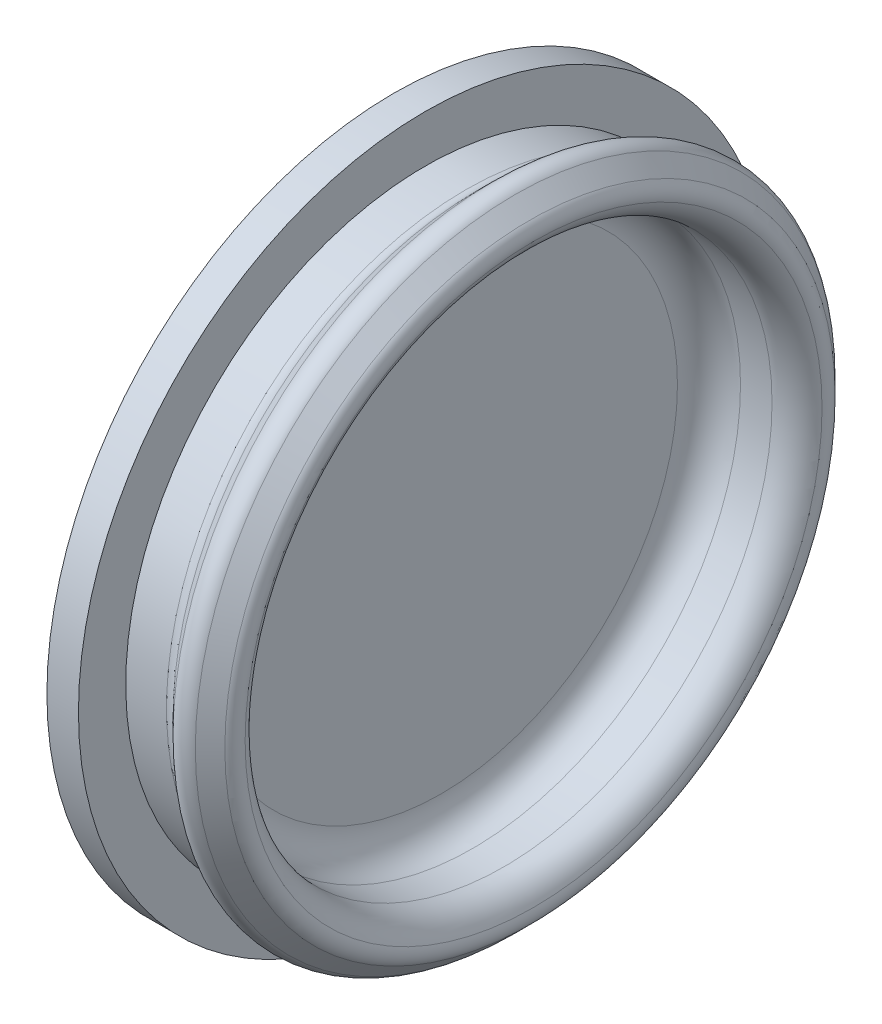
ISO-10303-21;
HEADER;
FILE_DESCRIPTION(('STEP AP214'),'2;1');
FILE_NAME('part.step','',(''),(''),'','','');
FILE_SCHEMA(('AUTOMOTIVE_DESIGN { 1 0 10303 214 1 1 1 1 }'));
ENDSEC;
DATA;
#1=APPLICATION_CONTEXT('core data for automotive mechanical design processes');
#2=APPLICATION_PROTOCOL_DEFINITION('international standard','automotive_design',2000,#1);
#3=PRODUCT_CONTEXT('',#1,'mechanical');
#4=PRODUCT('Part','Part','',(#3));
#5=PRODUCT_RELATED_PRODUCT_CATEGORY('part','',(#4));
#6=PRODUCT_DEFINITION_FORMATION('','',#4);
#7=PRODUCT_DEFINITION_CONTEXT('part definition',#1,'design');
#8=PRODUCT_DEFINITION('design','',#6,#7);
#9=PRODUCT_DEFINITION_SHAPE('','',#8);
#10=(LENGTH_UNIT() NAMED_UNIT(*) SI_UNIT(.MILLI.,.METRE.));
#11=(NAMED_UNIT(*) PLANE_ANGLE_UNIT() SI_UNIT($,.RADIAN.));
#12=(NAMED_UNIT(*) SI_UNIT($,.STERADIAN.) SOLID_ANGLE_UNIT());
#13=UNCERTAINTY_MEASURE_WITH_UNIT(LENGTH_MEASURE(1.E-05),#10,'distance_accuracy_value','');
#14=(GEOMETRIC_REPRESENTATION_CONTEXT(3) GLOBAL_UNCERTAINTY_ASSIGNED_CONTEXT((#13)) GLOBAL_UNIT_ASSIGNED_CONTEXT((#10,
#11,#12)) REPRESENTATION_CONTEXT('',''));
#15=CARTESIAN_POINT('',(0.,0.,0.));
#16=DIRECTION('',(0.,0.,1.));
#17=DIRECTION('',(1.,0.,0.));
#18=AXIS2_PLACEMENT_3D('',#15,#16,#17);
#19=CARTESIAN_POINT('',(-98.0736379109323,-38.6773773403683,66.3204962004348));
#20=DIRECTION('',(-1.,0.,0.));
#21=DIRECTION('',(0.,-1.,0.));
#22=AXIS2_PLACEMENT_3D('',#19,#20,#21);
#23=CYLINDRICAL_SURFACE('',#22,9.50000000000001);
#24=CARTESIAN_POINT('',(-98.2807446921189,-38.6773773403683,66.3204962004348));
#25=DIRECTION('',(1.,0.,0.));
#26=DIRECTION('',(0.,1.,0.));
#27=AXIS2_PLACEMENT_3D('',#24,#25,#26);
#28=CIRCLE('',#27,9.50000000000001);
#29=CARTESIAN_POINT('',(-98.2807446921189,-29.1773773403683,66.3204962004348));
#30=VERTEX_POINT('',#29);
#31=EDGE_CURVE('E48',#30,#30,#28,.F.);
#32=ORIENTED_EDGE('',*,*,#31,.T.);
#33=EDGE_LOOP('',(#32));
#34=FACE_BOUND('',#33,.T.);
#35=CARTESIAN_POINT('',(-99.5736379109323,-38.6773773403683,66.3204962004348));
#36=DIRECTION('',(-1.,0.,0.));
#37=DIRECTION('',(0.,-1.,0.));
#38=AXIS2_PLACEMENT_3D('',#35,#36,#37);
#39=CIRCLE('',#38,9.50000000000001);
#40=CARTESIAN_POINT('',(-99.5736379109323,-48.1773773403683,66.3204962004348));
#41=VERTEX_POINT('',#40);
#42=EDGE_CURVE('E68',#41,#41,#39,.T.);
#43=ORIENTED_EDGE('',*,*,#42,.F.);
#44=EDGE_LOOP('',(#43));
#45=FACE_BOUND('',#44,.T.);
#46=ADVANCED_FACE('F33',(#34,#45),#23,.T.);
#47=CARTESIAN_POINT('',(-100.573637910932,-38.6773773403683,66.3204962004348));
#48=DIRECTION('',(1.,0.,0.));
#49=DIRECTION('',(0.,1.,0.));
#50=AXIS2_PLACEMENT_3D('',#47,#48,#49);
#51=CYLINDRICAL_SURFACE('',#50,11.);
#52=CARTESIAN_POINT('',(-100.573637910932,-38.6773773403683,66.3204962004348));
#53=DIRECTION('',(-1.,0.,0.));
#54=DIRECTION('',(0.,-1.,0.));
#55=AXIS2_PLACEMENT_3D('',#52,#53,#54);
#56=CIRCLE('',#55,11.);
#57=CARTESIAN_POINT('',(-100.573637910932,-49.6773773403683,66.3204962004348));
#58=VERTEX_POINT('',#57);
#59=EDGE_CURVE('E71',#58,#58,#56,.T.);
#60=ORIENTED_EDGE('',*,*,#59,.F.);
#61=EDGE_LOOP('',(#60));
#62=FACE_BOUND('',#61,.T.);
#63=CARTESIAN_POINT('',(-99.5736379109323,-38.6773773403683,66.3204962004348));
#64=DIRECTION('',(-1.,0.,0.));
#65=DIRECTION('',(0.,-1.,0.));
#66=AXIS2_PLACEMENT_3D('',#63,#64,#65);
#67=CIRCLE('',#66,11.);
#68=CARTESIAN_POINT('',(-99.5736379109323,-49.6773773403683,66.3204962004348));
#69=VERTEX_POINT('',#68);
#70=EDGE_CURVE('E72',#69,#69,#67,.T.);
#71=ORIENTED_EDGE('',*,*,#70,.T.);
#72=EDGE_LOOP('',(#71));
#73=FACE_BOUND('',#72,.T.);
#74=ADVANCED_FACE('F80',(#62,#73),#51,.T.);
#75=CARTESIAN_POINT('',(-100.573637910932,-38.6773773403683,66.3204962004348));
#76=DIRECTION('',(-1.,0.,0.));
#77=DIRECTION('',(0.,-1.,0.));
#78=AXIS2_PLACEMENT_3D('',#75,#76,#77);
#79=PLANE('',#78);
#80=ORIENTED_EDGE('',*,*,#59,.T.);
#81=EDGE_LOOP('',(#80));
#82=FACE_BOUND('',#81,.T.);
#83=ADVANCED_FACE('F78',(#82),#79,.T.);
#84=CARTESIAN_POINT('',(-99.5736379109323,-38.6773773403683,66.3204962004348));
#85=DIRECTION('',(-1.,0.,0.));
#86=DIRECTION('',(0.,-1.,0.));
#87=AXIS2_PLACEMENT_3D('',#84,#85,#86);
#88=PLANE('',#87);
#89=ORIENTED_EDGE('',*,*,#42,.T.);
#90=EDGE_LOOP('',(#89));
#91=FACE_BOUND('',#90,.T.);
#92=ORIENTED_EDGE('',*,*,#70,.F.);
#93=EDGE_LOOP('',(#92));
#94=FACE_BOUND('',#93,.T.);
#95=ADVANCED_FACE('F86',(#91,#94),#88,.F.);
#96=CARTESIAN_POINT('',(-96.0736379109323,-38.6773773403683,66.3204962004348));
#97=DIRECTION('',(-1.,0.,0.));
#98=DIRECTION('',(0.,0.,1.));
#99=AXIS2_PLACEMENT_3D('',#96,#97,#98);
#100=CONICAL_SURFACE('',#99,9.50000000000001,0.785398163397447);
#101=CARTESIAN_POINT('',(-96.720084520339,-38.6773773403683,66.3204962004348));
#102=DIRECTION('',(1.,0.,0.));
#103=DIRECTION('',(0.,0.,-1.));
#104=AXIS2_PLACEMENT_3D('',#101,#102,#103);
#105=CIRCLE('',#104,10.1464466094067);
#106=CARTESIAN_POINT('',(-96.720084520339,-38.6773773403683,56.1740495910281));
#107=VERTEX_POINT('',#106);
#108=EDGE_CURVE('E40',#107,#107,#105,.T.);
#109=ORIENTED_EDGE('',*,*,#108,.T.);
#110=EDGE_LOOP('',(#109));
#111=FACE_BOUND('',#110,.T.);
#112=CARTESIAN_POINT('',(-96.2518407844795,-38.6773773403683,66.3204962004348));
#113=DIRECTION('',(1.,0.,0.));
#114=DIRECTION('',(0.,0.,-1.));
#115=AXIS2_PLACEMENT_3D('',#112,#113,#114);
#116=CIRCLE('',#115,9.67820287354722);
#117=CARTESIAN_POINT('',(-96.2518407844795,-38.6773773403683,56.6422933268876));
#118=VERTEX_POINT('',#117);
#119=EDGE_CURVE('E44',#118,#118,#116,.F.);
#120=ORIENTED_EDGE('',*,*,#119,.T.);
#121=EDGE_LOOP('',(#120));
#122=FACE_BOUND('',#121,.T.);
#123=ADVANCED_FACE('F88',(#111,#122),#100,.T.);
#124=CARTESIAN_POINT('',(-97.0736379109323,-38.6773773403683,66.3204962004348));
#125=DIRECTION('',(1.,0.,0.));
#126=DIRECTION('',(0.,0.,-1.));
#127=AXIS2_PLACEMENT_3D('',#124,#125,#126);
#128=CONICAL_SURFACE('',#127,10.5,0.785398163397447);
#129=CARTESIAN_POINT('',(-97.9271913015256,-38.6773773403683,66.3204962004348));
#130=DIRECTION('',(1.,0.,0.));
#131=DIRECTION('',(0.,0.,-1.));
#132=AXIS2_PLACEMENT_3D('',#129,#130,#131);
#133=CIRCLE('',#132,9.64644660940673);
#134=CARTESIAN_POINT('',(-97.9271913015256,-38.6773773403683,56.6740495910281));
#135=VERTEX_POINT('',#134);
#136=EDGE_CURVE('E53',#135,#135,#133,.T.);
#137=ORIENTED_EDGE('',*,*,#136,.T.);
#138=EDGE_LOOP('',(#137));
#139=FACE_BOUND('',#138,.T.);
#140=CARTESIAN_POINT('',(-97.4271913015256,-38.6773773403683,66.3204962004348));
#141=DIRECTION('',(-1.,0.,0.));
#142=DIRECTION('',(0.,0.,1.));
#143=AXIS2_PLACEMENT_3D('',#140,#141,#142);
#144=CIRCLE('',#143,10.1464466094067);
#145=CARTESIAN_POINT('',(-97.4271913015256,-38.6773773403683,76.4669428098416));
#146=VERTEX_POINT('',#145);
#147=EDGE_CURVE('E56',#146,#146,#144,.T.);
#148=ORIENTED_EDGE('',*,*,#147,.T.);
#149=EDGE_LOOP('',(#148));
#150=FACE_BOUND('',#149,.T.);
#151=ADVANCED_FACE('F95',(#139,#150),#128,.T.);
#152=CARTESIAN_POINT('',(-99.0736379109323,-38.6773773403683,66.3204962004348));
#153=DIRECTION('',(1.,0.,0.));
#154=DIRECTION('',(0.,0.,-1.));
#155=AXIS2_PLACEMENT_3D('',#152,#153,#154);
#156=CYLINDRICAL_SURFACE('',#155,8.50000000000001);
#157=CARTESIAN_POINT('',(-97.0736379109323,-38.6773773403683,66.3204962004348));
#158=DIRECTION('',(1.,0.,0.));
#159=DIRECTION('',(0.,0.,-1.));
#160=AXIS2_PLACEMENT_3D('',#157,#158,#159);
#161=CIRCLE('',#160,8.50000000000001);
#162=CARTESIAN_POINT('',(-97.0736379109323,-38.6773773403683,57.8204962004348));
#163=VERTEX_POINT('',#162);
#164=EDGE_CURVE('E62',#163,#163,#161,.T.);
#165=ORIENTED_EDGE('',*,*,#164,.T.);
#166=EDGE_LOOP('',(#165));
#167=FACE_BOUND('',#166,.T.);
#168=CARTESIAN_POINT('',(-98.0736379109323,-38.6773773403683,66.3204962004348));
#169=DIRECTION('',(1.,0.,0.));
#170=DIRECTION('',(0.,0.,-1.));
#171=AXIS2_PLACEMENT_3D('',#168,#169,#170);
#172=CIRCLE('',#171,8.50000000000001);
#173=CARTESIAN_POINT('',(-98.0736379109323,-38.6773773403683,57.8204962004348));
#174=VERTEX_POINT('',#173);
#175=EDGE_CURVE('E65',#174,#174,#172,.F.);
#176=ORIENTED_EDGE('',*,*,#175,.T.);
#177=EDGE_LOOP('',(#176));
#178=FACE_BOUND('',#177,.T.);
#179=ADVANCED_FACE('F127',(#167,#178),#156,.F.);
#180=CARTESIAN_POINT('',(-99.0736379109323,-38.6773773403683,66.3204962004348));
#181=DIRECTION('',(1.,0.,0.));
#182=DIRECTION('',(0.,0.,-1.));
#183=AXIS2_PLACEMENT_3D('',#180,#181,#182);
#184=PLANE('',#183);
#185=CARTESIAN_POINT('',(-99.0736379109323,-38.6773773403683,66.3204962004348));
#186=DIRECTION('',(1.,0.,0.));
#187=DIRECTION('',(0.,0.,-1.));
#188=AXIS2_PLACEMENT_3D('',#185,#186,#187);
#189=CIRCLE('',#188,7.50000000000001);
#190=CARTESIAN_POINT('',(-99.0736379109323,-38.6773773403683,58.8204962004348));
#191=VERTEX_POINT('',#190);
#192=EDGE_CURVE('E59',#191,#191,#189,.T.);
#193=ORIENTED_EDGE('',*,*,#192,.T.);
#194=EDGE_LOOP('',(#193));
#195=FACE_BOUND('',#194,.T.);
#196=ADVANCED_FACE('F109',(#195),#184,.T.);
#197=CARTESIAN_POINT('',(-97.0736379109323,-38.6773773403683,66.3204962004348));
#198=DIRECTION('',(1.,0.,0.));
#199=DIRECTION('',(0.,0.,-1.));
#200=AXIS2_PLACEMENT_3D('',#197,#198,#199);
#201=TOROIDAL_SURFACE('',#200,9.50000000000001,1.);
#202=CARTESIAN_POINT('',(-96.1371504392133,-38.6773773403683,66.3204962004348));
#203=DIRECTION('',(-1.,0.,0.));
#204=DIRECTION('',(0.,0.,1.));
#205=AXIS2_PLACEMENT_3D('',#202,#203,#204);
#206=CIRCLE('',#205,9.1492989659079);
#207=CARTESIAN_POINT('',(-96.1371504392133,-38.6773773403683,75.4697951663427));
#208=VERTEX_POINT('',#207);
#209=EDGE_CURVE('E10',#208,#208,#206,.F.);
#210=ORIENTED_EDGE('',*,*,#209,.T.);
#211=EDGE_LOOP('',(#210));
#212=FACE_BOUND('',#211,.T.);
#213=ORIENTED_EDGE('',*,*,#164,.F.);
#214=EDGE_LOOP('',(#213));
#215=FACE_BOUND('',#214,.T.);
#216=ADVANCED_FACE('F105',(#212,#215),#201,.T.);
#217=CARTESIAN_POINT('',(-98.0736379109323,-38.6773773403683,66.3204962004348));
#218=DIRECTION('',(1.,0.,0.));
#219=DIRECTION('',(0.,0.,-1.));
#220=AXIS2_PLACEMENT_3D('',#217,#218,#219);
#221=TOROIDAL_SURFACE('',#220,7.50000000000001,1.);
#222=ORIENTED_EDGE('',*,*,#175,.F.);
#223=EDGE_LOOP('',(#222));
#224=FACE_BOUND('',#223,.T.);
#225=ORIENTED_EDGE('',*,*,#192,.F.);
#226=EDGE_LOOP('',(#225));
#227=FACE_BOUND('',#226,.T.);
#228=ADVANCED_FACE('F108',(#224,#227),#221,.F.);
#229=CARTESIAN_POINT('',(-98.2807446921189,-38.6773773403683,66.3204962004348));
#230=DIRECTION('',(1.,0.,0.));
#231=DIRECTION('',(0.,1.,0.));
#232=AXIS2_PLACEMENT_3D('',#229,#230,#231);
#233=TOROIDAL_SURFACE('',#232,10.,0.5);
#234=ORIENTED_EDGE('',*,*,#31,.F.);
#235=EDGE_LOOP('',(#234));
#236=FACE_BOUND('',#235,.T.);
#237=ORIENTED_EDGE('',*,*,#136,.F.);
#238=EDGE_LOOP('',(#237));
#239=FACE_BOUND('',#238,.T.);
#240=ADVANCED_FACE('F112',(#236,#239),#233,.F.);
#241=CARTESIAN_POINT('',(-97.0736379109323,-38.6773773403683,66.3204962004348));
#242=DIRECTION('',(-1.,0.,0.));
#243=DIRECTION('',(0.,0.,1.));
#244=AXIS2_PLACEMENT_3D('',#241,#242,#243);
#245=TOROIDAL_SURFACE('',#244,9.79289321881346,0.5);
#246=ORIENTED_EDGE('',*,*,#147,.F.);
#247=EDGE_LOOP('',(#246));
#248=FACE_BOUND('',#247,.T.);
#249=ORIENTED_EDGE('',*,*,#108,.F.);
#250=EDGE_LOOP('',(#249));
#251=FACE_BOUND('',#250,.T.);
#252=ADVANCED_FACE('F115',(#248,#251),#245,.T.);
#253=CARTESIAN_POINT('',(-96.6053941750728,-38.6773773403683,66.3204962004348));
#254=DIRECTION('',(-1.,0.,0.));
#255=DIRECTION('',(0.,0.,1.));
#256=AXIS2_PLACEMENT_3D('',#253,#254,#255);
#257=TOROIDAL_SURFACE('',#256,9.32464948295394,0.5);
#258=ORIENTED_EDGE('',*,*,#119,.F.);
#259=EDGE_LOOP('',(#258));
#260=FACE_BOUND('',#259,.T.);
#261=ORIENTED_EDGE('',*,*,#209,.F.);
#262=EDGE_LOOP('',(#261));
#263=FACE_BOUND('',#262,.T.);
#264=ADVANCED_FACE('F35',(#260,#263),#257,.T.);
#265=CLOSED_SHELL('',(#46,#74,#83,#95,#123,#151,#179,#196,#216,#228,#240,#252,#264));
#266=MANIFOLD_SOLID_BREP('B2',#265);
#267=ADVANCED_BREP_SHAPE_REPRESENTATION('',(#18,#266),#14);
#268=SHAPE_DEFINITION_REPRESENTATION(#9,#267);
ENDSEC;
END-ISO-10303-21;
